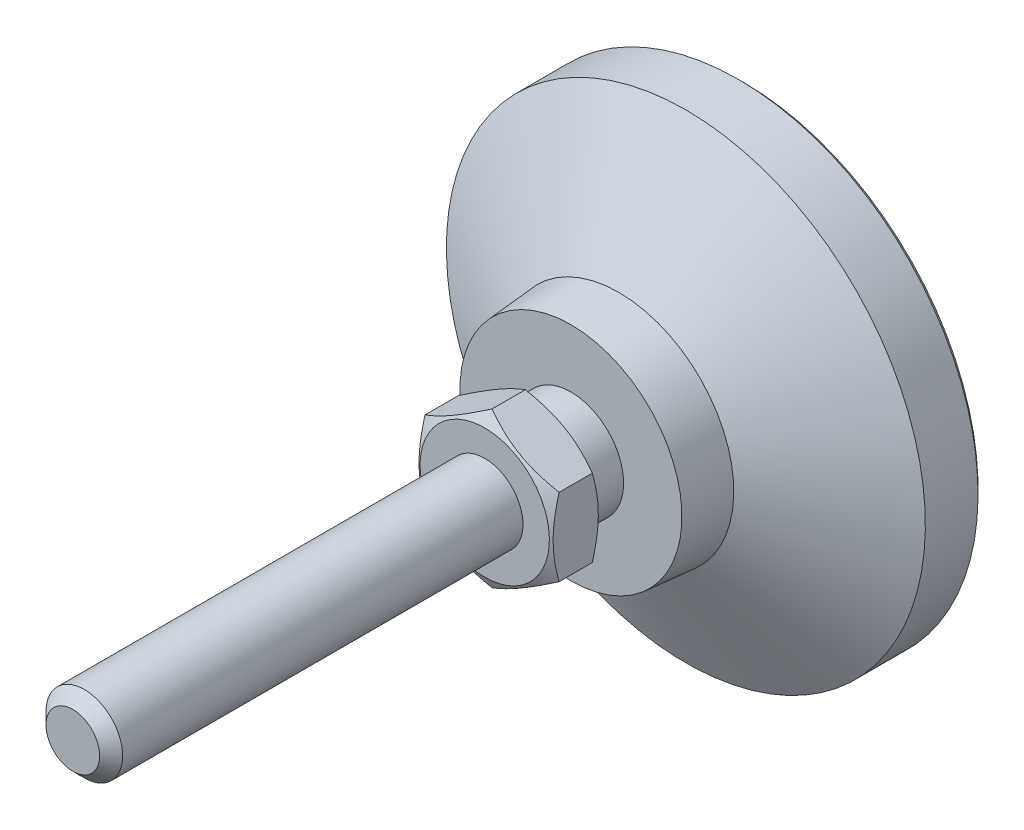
ISO-10303-21;
HEADER;
FILE_DESCRIPTION(('STEP AP214'),'2;1');
FILE_NAME('part.step','',(''),(''),'','','');
FILE_SCHEMA(('AUTOMOTIVE_DESIGN { 1 0 10303 214 1 1 1 1 }'));
ENDSEC;
DATA;
#1=APPLICATION_CONTEXT('core data for automotive mechanical design processes');
#2=APPLICATION_PROTOCOL_DEFINITION('international standard','automotive_design',2000,#1);
#3=PRODUCT_CONTEXT('',#1,'mechanical');
#4=PRODUCT('Part','Part','',(#3));
#5=PRODUCT_RELATED_PRODUCT_CATEGORY('part','',(#4));
#6=PRODUCT_DEFINITION_FORMATION('','',#4);
#7=PRODUCT_DEFINITION_CONTEXT('part definition',#1,'design');
#8=PRODUCT_DEFINITION('design','',#6,#7);
#9=PRODUCT_DEFINITION_SHAPE('','',#8);
#10=(LENGTH_UNIT() NAMED_UNIT(*) SI_UNIT(.MILLI.,.METRE.));
#11=(NAMED_UNIT(*) PLANE_ANGLE_UNIT() SI_UNIT($,.RADIAN.));
#12=(NAMED_UNIT(*) SI_UNIT($,.STERADIAN.) SOLID_ANGLE_UNIT());
#13=UNCERTAINTY_MEASURE_WITH_UNIT(LENGTH_MEASURE(1.E-05),#10,'distance_accuracy_value','');
#14=(GEOMETRIC_REPRESENTATION_CONTEXT(3) GLOBAL_UNCERTAINTY_ASSIGNED_CONTEXT((#13)) GLOBAL_UNIT_ASSIGNED_CONTEXT((#10,
#11,#12)) REPRESENTATION_CONTEXT('',''));
#15=CARTESIAN_POINT('',(0.,0.,0.));
#16=DIRECTION('',(0.,0.,1.));
#17=DIRECTION('',(1.,0.,0.));
#18=AXIS2_PLACEMENT_3D('',#15,#16,#17);
#19=CARTESIAN_POINT('',(0.,0.,-1.));
#20=DIRECTION('',(0.,0.,-1.));
#21=DIRECTION('',(0.,1.,0.));
#22=AXIS2_PLACEMENT_3D('',#19,#20,#21);
#23=CYLINDRICAL_SURFACE('',#22,5.49999999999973);
#24=CARTESIAN_POINT('',(0.,0.,22.));
#25=DIRECTION('',(0.,0.,-1.));
#26=DIRECTION('',(0.,1.,0.));
#27=AXIS2_PLACEMENT_3D('',#24,#25,#26);
#28=CIRCLE('',#27,5.49999999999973);
#29=CARTESIAN_POINT('',(0.,5.49999999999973,22.));
#30=VERTEX_POINT('',#29);
#31=EDGE_CURVE('E110',#30,#30,#28,.T.);
#32=ORIENTED_EDGE('',*,*,#31,.T.);
#33=EDGE_LOOP('',(#32));
#34=FACE_BOUND('',#33,.T.);
#35=CARTESIAN_POINT('',(0.,0.,18.));
#36=DIRECTION('',(0.,0.,-1.));
#37=DIRECTION('',(0.,1.,0.));
#38=AXIS2_PLACEMENT_3D('',#35,#36,#37);
#39=CIRCLE('',#38,5.49999999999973);
#40=CARTESIAN_POINT('',(0.,5.49999999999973,18.));
#41=VERTEX_POINT('',#40);
#42=EDGE_CURVE('E96',#41,#41,#39,.T.);
#43=ORIENTED_EDGE('',*,*,#42,.F.);
#44=EDGE_LOOP('',(#43));
#45=FACE_BOUND('',#44,.T.);
#46=ADVANCED_FACE('F14',(#34,#45),#23,.T.);
#47=CARTESIAN_POINT('',(-5.49999999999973,0.,22.));
#48=DIRECTION('',(0.,0.,1.));
#49=DIRECTION('',(0.,-1.,0.));
#50=AXIS2_PLACEMENT_3D('',#47,#48,#49);
#51=PLANE('',#50);
#52=CARTESIAN_POINT('',(0.,0.,22.));
#53=DIRECTION('',(0.,0.,1.));
#54=DIRECTION('',(0.,-1.,0.));
#55=AXIS2_PLACEMENT_3D('',#52,#53,#54);
#56=CIRCLE('',#55,6.75);
#57=CARTESIAN_POINT('',(0.,-6.75,22.));
#58=VERTEX_POINT('',#57);
#59=EDGE_CURVE('E85',#58,#58,#56,.T.);
#60=ORIENTED_EDGE('',*,*,#59,.F.);
#61=EDGE_LOOP('',(#60));
#62=FACE_BOUND('',#61,.T.);
#63=ORIENTED_EDGE('',*,*,#31,.F.);
#64=EDGE_LOOP('',(#63));
#65=FACE_BOUND('',#64,.T.);
#66=ADVANCED_FACE('F225',(#62,#65),#51,.F.);
#67=CARTESIAN_POINT('',(0.,-5.49999999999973,18.));
#68=DIRECTION('',(0.,0.,1.));
#69=DIRECTION('',(0.,-1.,0.));
#70=AXIS2_PLACEMENT_3D('',#67,#68,#69);
#71=PLANE('',#70);
#72=ORIENTED_EDGE('',*,*,#42,.T.);
#73=EDGE_LOOP('',(#72));
#74=FACE_BOUND('',#73,.T.);
#75=CARTESIAN_POINT('',(0.,0.,18.));
#76=DIRECTION('',(0.,0.,1.));
#77=DIRECTION('',(0.,-1.,0.));
#78=AXIS2_PLACEMENT_3D('',#75,#76,#77);
#79=CIRCLE('',#78,11.5833333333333);
#80=CARTESIAN_POINT('',(0.,-11.5833333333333,18.));
#81=VERTEX_POINT('',#80);
#82=EDGE_CURVE('E91',#81,#81,#79,.T.);
#83=ORIENTED_EDGE('',*,*,#82,.T.);
#84=EDGE_LOOP('',(#83));
#85=FACE_BOUND('',#84,.T.);
#86=ADVANCED_FACE('F137',(#74,#85),#71,.T.);
#87=CARTESIAN_POINT('',(0.,0.,0.));
#88=DIRECTION('',(0.,0.,-1.));
#89=DIRECTION('',(0.,1.,0.));
#90=AXIS2_PLACEMENT_3D('',#87,#88,#89);
#91=PLANE('',#90);
#92=CARTESIAN_POINT('',(0.,0.,0.));
#93=DIRECTION('',(0.,0.,-1.));
#94=DIRECTION('',(0.,1.,0.));
#95=AXIS2_PLACEMENT_3D('',#92,#93,#94);
#96=CIRCLE('',#95,24.5);
#97=CARTESIAN_POINT('',(0.,24.5,0.));
#98=VERTEX_POINT('',#97);
#99=EDGE_CURVE('E118',#98,#98,#96,.T.);
#100=ORIENTED_EDGE('',*,*,#99,.T.);
#101=EDGE_LOOP('',(#100));
#102=FACE_BOUND('',#101,.T.);
#103=ADVANCED_FACE('F182',(#102),#91,.T.);
#104=CARTESIAN_POINT('',(0.,0.,-1.));
#105=DIRECTION('',(0.,0.,-1.));
#106=DIRECTION('',(0.,1.,0.));
#107=AXIS2_PLACEMENT_3D('',#104,#105,#106);
#108=CYLINDRICAL_SURFACE('',#107,25.);
#109=CARTESIAN_POINT('',(0.,0.,0.500000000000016));
#110=DIRECTION('',(0.,0.,-1.));
#111=DIRECTION('',(0.,1.,0.));
#112=AXIS2_PLACEMENT_3D('',#109,#110,#111);
#113=CIRCLE('',#112,25.);
#114=CARTESIAN_POINT('',(0.,25.,0.500000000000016));
#115=VERTEX_POINT('',#114);
#116=EDGE_CURVE('E122',#115,#115,#113,.F.);
#117=ORIENTED_EDGE('',*,*,#116,.T.);
#118=EDGE_LOOP('',(#117));
#119=FACE_BOUND('',#118,.T.);
#120=CARTESIAN_POINT('',(0.,0.,6.00000000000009));
#121=DIRECTION('',(0.,0.,-1.));
#122=DIRECTION('',(0.,1.,0.));
#123=AXIS2_PLACEMENT_3D('',#120,#121,#122);
#124=CIRCLE('',#123,25.);
#125=CARTESIAN_POINT('',(0.,25.,6.00000000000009));
#126=VERTEX_POINT('',#125);
#127=EDGE_CURVE('E116',#126,#126,#124,.T.);
#128=ORIENTED_EDGE('',*,*,#127,.T.);
#129=EDGE_LOOP('',(#128));
#130=FACE_BOUND('',#129,.T.);
#131=ADVANCED_FACE('F243',(#119,#130),#108,.T.);
#132=CARTESIAN_POINT('',(0.,0.,13.));
#133=DIRECTION('',(0.,0.,-1.));
#134=DIRECTION('',(0.,1.,0.));
#135=AXIS2_PLACEMENT_3D('',#132,#133,#134);
#136=CONICAL_SURFACE('',#135,12.,1.07685495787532);
#137=ORIENTED_EDGE('',*,*,#127,.F.);
#138=EDGE_LOOP('',(#137));
#139=FACE_BOUND('',#138,.T.);
#140=CARTESIAN_POINT('',(0.,0.,13.));
#141=DIRECTION('',(0.,0.,-1.));
#142=DIRECTION('',(0.,1.,0.));
#143=AXIS2_PLACEMENT_3D('',#140,#141,#142);
#144=CIRCLE('',#143,12.);
#145=CARTESIAN_POINT('',(0.,12.,13.));
#146=VERTEX_POINT('',#145);
#147=EDGE_CURVE('E113',#146,#146,#144,.T.);
#148=ORIENTED_EDGE('',*,*,#147,.T.);
#149=EDGE_LOOP('',(#148));
#150=FACE_BOUND('',#149,.T.);
#151=ADVANCED_FACE('F240',(#139,#150),#136,.T.);
#152=CARTESIAN_POINT('',(0.,0.,19.));
#153=DIRECTION('',(0.,0.,-1.));
#154=DIRECTION('',(0.,1.,0.));
#155=AXIS2_PLACEMENT_3D('',#152,#153,#154);
#156=CONICAL_SURFACE('',#155,11.5,0.0831412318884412);
#157=ORIENTED_EDGE('',*,*,#147,.F.);
#158=EDGE_LOOP('',(#157));
#159=FACE_BOUND('',#158,.T.);
#160=ORIENTED_EDGE('',*,*,#82,.F.);
#161=EDGE_LOOP('',(#160));
#162=FACE_BOUND('',#161,.T.);
#163=ADVANCED_FACE('F237',(#159,#162),#156,.T.);
#164=CARTESIAN_POINT('',(0.,0.,0.));
#165=DIRECTION('',(0.,0.,1.));
#166=DIRECTION('',(0.,-1.,0.));
#167=AXIS2_PLACEMENT_3D('',#164,#165,#166);
#168=CONICAL_SURFACE('',#167,24.5,0.785398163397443);
#169=ORIENTED_EDGE('',*,*,#116,.F.);
#170=EDGE_LOOP('',(#169));
#171=FACE_BOUND('',#170,.T.);
#172=ORIENTED_EDGE('',*,*,#99,.F.);
#173=EDGE_LOOP('',(#172));
#174=FACE_BOUND('',#173,.T.);
#175=ADVANCED_FACE('F16',(#171,#174),#168,.T.);
#176=CARTESIAN_POINT('',(0.,0.,22.));
#177=DIRECTION('',(0.,0.,1.));
#178=DIRECTION('',(0.,-1.,0.));
#179=AXIS2_PLACEMENT_3D('',#176,#177,#178);
#180=CONICAL_SURFACE('',#179,6.75,1.0471975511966);
#181=CARTESIAN_POINT('',(0.000200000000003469,-8.0830192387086,22.7696190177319));
#182=CARTESIAN_POINT('',(-0.15366790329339,-7.99418356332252,22.7183374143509));
#183=CARTESIAN_POINT('',(-0.308109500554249,-7.90501666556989,22.669383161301));
#184=CARTESIAN_POINT('',(-0.618246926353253,-7.72595873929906,22.5767703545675));
#185=CARTESIAN_POINT('',(-0.773943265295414,-7.63606741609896,22.5331140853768));
#186=CARTESIAN_POINT('',(-1.24352516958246,-7.36495417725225,22.4109491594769));
#187=CARTESIAN_POINT('',(-1.5592643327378,-7.18266208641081,22.3414631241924));
#188=CARTESIAN_POINT('',(-2.03176224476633,-6.90986528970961,22.2599825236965));
#189=CARTESIAN_POINT('',(-2.18710922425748,-6.82017566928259,22.2367710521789));
#190=CARTESIAN_POINT('',(-2.49850511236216,-6.64039116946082,22.1978487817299));
#191=CARTESIAN_POINT('',(-2.65455395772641,-6.55029632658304,22.1821373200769));
#192=CARTESIAN_POINT('',(-2.96692267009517,-6.36995016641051,22.1586154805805));
#193=CARTESIAN_POINT('',(-3.12324202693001,-6.27969914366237,22.1507961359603));
#194=CARTESIAN_POINT('',(-3.43601650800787,-6.09911871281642,22.1432178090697));
#195=CARTESIAN_POINT('',(-3.59247162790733,-6.00878930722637,22.1434585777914));
#196=CARTESIAN_POINT('',(-4.02110687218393,-5.76131663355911,22.155197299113));
#197=CARTESIAN_POINT('',(-4.29314668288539,-5.60425437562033,22.1749033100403));
#198=CARTESIAN_POINT('',(-4.83541944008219,-5.29117305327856,22.2373910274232));
#199=CARTESIAN_POINT('',(-5.10565047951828,-5.13515508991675,22.2801940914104));
#200=CARTESIAN_POINT('',(-5.64901454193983,-4.82144370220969,22.3871892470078));
#201=CARTESIAN_POINT('',(-5.92207900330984,-4.6637898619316,22.4518346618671));
#202=CARTESIAN_POINT('',(-6.46413578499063,-4.35083323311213,22.5985536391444));
#203=CARTESIAN_POINT('',(-6.73313504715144,-4.19552643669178,22.680592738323));
#204=CARTESIAN_POINT('',(-7.0002,-4.04133641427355,22.7696190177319));
#205=B_SPLINE_CURVE_WITH_KNOTS('',3,(#181,#182,#183,#184,#185,#186,#187,#188,#189,#190,#191,
#192,#193,#194,#195,#196,#197,#198,#199,#200,#201,#202,#203,#204),.UNSPECIFIED.,.F.,.F.,(4,2,2,
2,2,2,2,2,2,2,2,4),(0.,0.554727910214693,1.10969417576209,2.2219327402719,2.76443041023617,
3.30688013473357,3.84871284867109,4.39052882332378,5.33376515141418,6.27787517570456,
7.2429241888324,8.20607866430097),.UNSPECIFIED.);
#206=CARTESIAN_POINT('',(0.,-8.08290376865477,22.7695523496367));
#207=VERTEX_POINT('',#206);
#208=CARTESIAN_POINT('',(-7.,-4.04145188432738,22.7695523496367));
#209=VERTEX_POINT('',#208);
#210=EDGE_CURVE('E90',#207,#209,#205,.T.);
#211=ORIENTED_EDGE('',*,*,#210,.T.);
#212=CARTESIAN_POINT('',(-7.,10.8261952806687,25.5461489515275));
#213=CARTESIAN_POINT('',(-7.,10.5207055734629,25.3980784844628));
#214=CARTESIAN_POINT('',(-7.,10.2145114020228,25.2514363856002));
#215=CARTESIAN_POINT('',(-7.,9.60033936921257,24.9618128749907));
#216=CARTESIAN_POINT('',(-7.,9.29236123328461,24.818832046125));
#217=CARTESIAN_POINT('',(-7.,8.6726454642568,24.5366093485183));
#218=CARTESIAN_POINT('',(-7.,8.36089647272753,24.3973923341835));
#219=CARTESIAN_POINT('',(-7.,7.7349085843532,24.1246953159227));
#220=CARTESIAN_POINT('',(-7.,7.42066980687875,23.9912150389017));
#221=CARTESIAN_POINT('',(-7.,6.77917625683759,23.7273836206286));
#222=CARTESIAN_POINT('',(-7.,6.4518248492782,23.5972661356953));
#223=CARTESIAN_POINT('',(-7.,5.79328211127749,23.346950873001));
#224=CARTESIAN_POINT('',(-7.,5.46209035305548,23.2267542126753));
#225=CARTESIAN_POINT('',(-7.,4.79596552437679,22.9994580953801));
#226=CARTESIAN_POINT('',(-7.,4.46104168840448,22.892331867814));
#227=CARTESIAN_POINT('',(-7.,3.78640204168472,22.6946321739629));
#228=CARTESIAN_POINT('',(-7.,3.44668778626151,22.6040534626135));
#229=CARTESIAN_POINT('',(-7.,2.76409652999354,22.4443011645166));
#230=CARTESIAN_POINT('',(-7.,2.42124716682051,22.3750126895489));
#231=CARTESIAN_POINT('',(-7.,1.90387487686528,22.2900623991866));
#232=CARTESIAN_POINT('',(-7.,1.73088814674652,22.2649082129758));
#233=CARTESIAN_POINT('',(-7.,1.38406496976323,22.2214213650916));
#234=CARTESIAN_POINT('',(-7.,1.21022860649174,22.2030880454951));
#235=CARTESIAN_POINT('',(-7.,0.864197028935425,22.1738365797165));
#236=CARTESIAN_POINT('',(-7.,0.692009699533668,22.1628255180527));
#237=CARTESIAN_POINT('',(-7.,0.34732385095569,22.1480926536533));
#238=CARTESIAN_POINT('',(-7.,0.174825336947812,22.1443707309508));
#239=CARTESIAN_POINT('',(-7.,-0.170174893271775,22.1443048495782));
#240=CARTESIAN_POINT('',(-7.,-0.342676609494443,22.1479609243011));
#241=CARTESIAN_POINT('',(-7.,-0.687373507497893,22.1625622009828));
#242=CARTESIAN_POINT('',(-7.,-0.859568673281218,22.1735077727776));
#243=CARTESIAN_POINT('',(-7.,-1.27430760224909,22.2084187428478));
#244=CARTESIAN_POINT('',(-7.,-1.5165621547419,22.235892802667));
#245=CARTESIAN_POINT('',(-7.,-1.99924233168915,22.3037628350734));
#246=CARTESIAN_POINT('',(-7.,-2.2396676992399,22.3441605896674));
#247=CARTESIAN_POINT('',(-7.,-2.9579424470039,22.4825946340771));
#248=CARTESIAN_POINT('',(-7.,-3.43251618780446,22.5978455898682));
#249=CARTESIAN_POINT('',(-7.,-4.14209330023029,22.7973137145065));
#250=CARTESIAN_POINT('',(-7.,-4.38078691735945,22.8691550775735));
#251=CARTESIAN_POINT('',(-7.,-4.85585510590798,23.0202030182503));
#252=CARTESIAN_POINT('',(-7.,-5.09222966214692,23.0994096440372));
#253=CARTESIAN_POINT('',(-7.,-5.56273596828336,23.2639252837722));
#254=CARTESIAN_POINT('',(-7.,-5.79686845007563,23.3492322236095));
#255=CARTESIAN_POINT('',(-7.,-6.26320003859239,23.5249543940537));
#256=CARTESIAN_POINT('',(-7.,-6.49539916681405,23.6153695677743));
#257=CARTESIAN_POINT('',(-7.,-7.03870646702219,23.8327117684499));
#258=CARTESIAN_POINT('',(-7.,-7.34911564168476,23.9613827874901));
#259=CARTESIAN_POINT('',(-7.,-7.96733547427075,24.2248403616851));
#260=CARTESIAN_POINT('',(-7.,-8.27514597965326,24.3596272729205));
#261=CARTESIAN_POINT('',(-7.,-8.88864034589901,24.6341014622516));
#262=CARTESIAN_POINT('',(-7.,-9.19432378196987,24.7737896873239));
#263=CARTESIAN_POINT('',(-7.,-9.80386715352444,25.0570964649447));
#264=CARTESIAN_POINT('',(-7.,-10.1077270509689,25.2007150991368));
#265=CARTESIAN_POINT('',(-7.,-10.7142274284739,25.4913001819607));
#266=CARTESIAN_POINT('',(-7.,-11.0168663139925,25.6382699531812));
#267=CARTESIAN_POINT('',(-7.,-11.6208489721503,25.9348494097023));
#268=CARTESIAN_POINT('',(-7.,-11.9221927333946,26.0844591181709));
#269=CARTESIAN_POINT('',(-7.,-12.8245105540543,26.5365141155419));
#270=CARTESIAN_POINT('',(-7.,-13.4238493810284,26.8422230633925));
#271=CARTESIAN_POINT('',(-7.,-14.5699747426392,27.4342763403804));
#272=CARTESIAN_POINT('',(-7.,-15.1170134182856,27.7201347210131));
#273=CARTESIAN_POINT('',(-7.,-16.209054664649,28.2957564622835));
#274=CARTESIAN_POINT('',(-7.,-16.7540571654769,28.5855199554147));
#275=CARTESIAN_POINT('',(-7.,-17.8411487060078,29.1673182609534));
#276=CARTESIAN_POINT('',(-7.,-18.3832416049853,29.4593458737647));
#277=CARTESIAN_POINT('',(-7.,-19.4661229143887,30.0457416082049));
#278=CARTESIAN_POINT('',(-7.,-20.0069113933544,30.3401096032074));
#279=CARTESIAN_POINT('',(-7.,-20.547218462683,30.6353526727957));
#280=B_SPLINE_CURVE_WITH_KNOTS('',3,(#212,#213,#214,#215,#216,#217,#218,#219,#220,#221,#222,
#223,#224,#225,#226,#227,#228,#229,#230,#231,#232,#233,#234,#235,#236,#237,#238,#239,#240,#241,
#242,#243,#244,#245,#246,#247,#248,#249,#250,#251,#252,#253,#254,#255,#256,#257,#258,#259,#260,
#261,#262,#263,#264,#265,#266,#267,#268,#269,#270,#271,#272,#273,#274,#275,#276,#277,#278,#279),
.UNSPECIFIED.,.F.,.F.,(4,2,2,2,2,2,2,2,2,2,2,2,2,2,2,2,2,2,2,2,2,2,2,2,2,2,2,2,2,2,2,2,2,4),(0.,
1.01846209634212,2.03708533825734,3.06130428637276,4.08547442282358,5.14213987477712,
6.19892418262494,7.25350631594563,8.30775359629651,9.35620768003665,9.88051238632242,
10.4047665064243,10.9222342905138,11.4396935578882,11.9571551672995,12.4746430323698,
13.2056518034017,13.936761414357,15.3998035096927,16.1475540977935,16.8953095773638,
17.6428120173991,18.3903061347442,19.3982811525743,20.4063149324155,21.4145445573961,
22.422795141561,23.4320930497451,24.4413998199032,26.4597527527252,28.3114100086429,
30.1631302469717,32.0103662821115,33.857503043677),.UNSPECIFIED.);
#281=CARTESIAN_POINT('',(-7.,4.04145188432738,22.7695523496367));
#282=VERTEX_POINT('',#281);
#283=EDGE_CURVE('E166',#209,#282,#280,.F.);
#284=ORIENTED_EDGE('',*,*,#283,.T.);
#285=CARTESIAN_POINT('',(-7.0002,4.04133641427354,22.7696190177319));
#286=CARTESIAN_POINT('',(-6.84633209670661,4.13017208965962,22.7183374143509));
#287=CARTESIAN_POINT('',(-6.69189049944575,4.21933898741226,22.669383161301));
#288=CARTESIAN_POINT('',(-6.38175307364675,4.39839691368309,22.5767703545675));
#289=CARTESIAN_POINT('',(-6.22605673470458,4.48828823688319,22.5331140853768));
#290=CARTESIAN_POINT('',(-5.75647483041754,4.75940147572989,22.4109491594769));
#291=CARTESIAN_POINT('',(-5.4407356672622,4.94169356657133,22.3414631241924));
#292=CARTESIAN_POINT('',(-4.96823775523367,5.21449036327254,22.2599825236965));
#293=CARTESIAN_POINT('',(-4.81289077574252,5.30417998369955,22.2367710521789));
#294=CARTESIAN_POINT('',(-4.50149488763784,5.48396448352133,22.1978487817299));
#295=CARTESIAN_POINT('',(-4.34544604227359,5.57405932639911,22.1821373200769));
#296=CARTESIAN_POINT('',(-4.03307732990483,5.75440548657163,22.1586154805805));
#297=CARTESIAN_POINT('',(-3.87675797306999,5.84465650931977,22.1507961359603));
#298=CARTESIAN_POINT('',(-3.56398349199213,6.02523694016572,22.1432178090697));
#299=CARTESIAN_POINT('',(-3.40752837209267,6.11556634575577,22.1434585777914));
#300=CARTESIAN_POINT('',(-2.97889312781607,6.36303901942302,22.155197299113));
#301=CARTESIAN_POINT('',(-2.7068533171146,6.52010127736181,22.1749033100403));
#302=CARTESIAN_POINT('',(-2.16458055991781,6.83318259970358,22.2373910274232));
#303=CARTESIAN_POINT('',(-1.89434952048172,6.9892005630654,22.2801940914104));
#304=CARTESIAN_POINT('',(-1.35098545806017,7.30291195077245,22.3871892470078));
#305=CARTESIAN_POINT('',(-1.07792099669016,7.46056579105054,22.4518346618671));
#306=CARTESIAN_POINT('',(-0.535864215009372,7.77352241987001,22.5985536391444));
#307=CARTESIAN_POINT('',(-0.266864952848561,7.92882921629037,22.680592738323));
#308=CARTESIAN_POINT('',(0.000199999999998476,8.0830192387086,22.7696190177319));
#309=B_SPLINE_CURVE_WITH_KNOTS('',3,(#285,#286,#287,#288,#289,#290,#291,#292,#293,#294,#295,
#296,#297,#298,#299,#300,#301,#302,#303,#304,#305,#306,#307,#308),.UNSPECIFIED.,.F.,.F.,(4,2,2,
2,2,2,2,2,2,2,2,4),(0.,0.554727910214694,1.10969417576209,2.2219327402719,2.76443041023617,
3.30688013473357,3.84871284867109,4.39052882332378,5.33376515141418,6.27787517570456,
7.2429241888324,8.20607866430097),.UNSPECIFIED.);
#310=CARTESIAN_POINT('',(0.,8.08290376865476,22.7695523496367));
#311=VERTEX_POINT('',#310);
#312=EDGE_CURVE('E159',#282,#311,#309,.T.);
#313=ORIENTED_EDGE('',*,*,#312,.T.);
#314=CARTESIAN_POINT('',(-0.000200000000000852,8.0830192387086,22.7696190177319));
#315=CARTESIAN_POINT('',(0.153667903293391,7.99418356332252,22.7183374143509));
#316=CARTESIAN_POINT('',(0.308109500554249,7.90501666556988,22.669383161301));
#317=CARTESIAN_POINT('',(0.618246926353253,7.72595873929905,22.5767703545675));
#318=CARTESIAN_POINT('',(0.773943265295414,7.63606741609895,22.5331140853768));
#319=CARTESIAN_POINT('',(1.24352516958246,7.36495417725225,22.4109491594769));
#320=CARTESIAN_POINT('',(1.5592643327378,7.18266208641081,22.3414631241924));
#321=CARTESIAN_POINT('',(2.03176224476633,6.9098652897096,22.2599825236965));
#322=CARTESIAN_POINT('',(2.18710922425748,6.82017566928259,22.2367710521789));
#323=CARTESIAN_POINT('',(2.49850511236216,6.64039116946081,22.1978487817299));
#324=CARTESIAN_POINT('',(2.65455395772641,6.55029632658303,22.1821373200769));
#325=CARTESIAN_POINT('',(2.96692267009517,6.36995016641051,22.1586154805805));
#326=CARTESIAN_POINT('',(3.12324202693,6.27969914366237,22.1507961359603));
#327=CARTESIAN_POINT('',(3.43601650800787,6.09911871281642,22.1432178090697));
#328=CARTESIAN_POINT('',(3.59247162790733,6.00878930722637,22.1434585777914));
#329=CARTESIAN_POINT('',(4.02110687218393,5.76131663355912,22.155197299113));
#330=CARTESIAN_POINT('',(4.2931466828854,5.60425437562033,22.1749033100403));
#331=CARTESIAN_POINT('',(4.83541944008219,5.29117305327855,22.2373910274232));
#332=CARTESIAN_POINT('',(5.10565047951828,5.13515508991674,22.2801940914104));
#333=CARTESIAN_POINT('',(5.64901454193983,4.82144370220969,22.3871892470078));
#334=CARTESIAN_POINT('',(5.92207900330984,4.66378986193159,22.4518346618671));
#335=CARTESIAN_POINT('',(6.46413578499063,4.35083323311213,22.5985536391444));
#336=CARTESIAN_POINT('',(6.73313504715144,4.19552643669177,22.680592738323));
#337=CARTESIAN_POINT('',(7.0002,4.04133641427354,22.7696190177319));
#338=B_SPLINE_CURVE_WITH_KNOTS('',3,(#314,#315,#316,#317,#318,#319,#320,#321,#322,#323,#324,
#325,#326,#327,#328,#329,#330,#331,#332,#333,#334,#335,#336,#337),.UNSPECIFIED.,.F.,.F.,(4,2,2,
2,2,2,2,2,2,2,2,4),(0.,0.554727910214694,1.10969417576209,2.2219327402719,2.76443041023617,
3.30688013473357,3.8487128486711,4.39052882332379,5.33376515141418,6.27787517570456,
7.2429241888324,8.20607866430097),.UNSPECIFIED.);
#339=CARTESIAN_POINT('',(7.,4.04145188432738,22.7695523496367));
#340=VERTEX_POINT('',#339);
#341=EDGE_CURVE('E152',#311,#340,#338,.T.);
#342=ORIENTED_EDGE('',*,*,#341,.T.);
#343=CARTESIAN_POINT('',(7.,10.8261952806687,25.5461489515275));
#344=CARTESIAN_POINT('',(7.,10.5207055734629,25.3980784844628));
#345=CARTESIAN_POINT('',(7.,10.2145114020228,25.2514363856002));
#346=CARTESIAN_POINT('',(7.,9.60033936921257,24.9618128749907));
#347=CARTESIAN_POINT('',(7.,9.29236123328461,24.818832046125));
#348=CARTESIAN_POINT('',(7.,8.6726454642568,24.5366093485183));
#349=CARTESIAN_POINT('',(7.,8.36089647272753,24.3973923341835));
#350=CARTESIAN_POINT('',(7.,7.7349085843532,24.1246953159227));
#351=CARTESIAN_POINT('',(7.,7.42066980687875,23.9912150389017));
#352=CARTESIAN_POINT('',(7.,6.77917625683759,23.7273836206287));
#353=CARTESIAN_POINT('',(7.,6.45182484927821,23.5972661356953));
#354=CARTESIAN_POINT('',(7.,5.79328211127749,23.346950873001));
#355=CARTESIAN_POINT('',(7.,5.46209035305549,23.2267542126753));
#356=CARTESIAN_POINT('',(7.,4.7959655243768,22.9994580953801));
#357=CARTESIAN_POINT('',(7.,4.46104168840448,22.892331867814));
#358=CARTESIAN_POINT('',(7.,3.78640204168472,22.6946321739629));
#359=CARTESIAN_POINT('',(7.,3.44668778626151,22.6040534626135));
#360=CARTESIAN_POINT('',(7.,2.76409652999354,22.4443011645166));
#361=CARTESIAN_POINT('',(7.,2.42124716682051,22.3750126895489));
#362=CARTESIAN_POINT('',(7.,1.90387487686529,22.2900623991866));
#363=CARTESIAN_POINT('',(7.,1.73088814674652,22.2649082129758));
#364=CARTESIAN_POINT('',(7.,1.38406496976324,22.2214213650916));
#365=CARTESIAN_POINT('',(7.,1.21022860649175,22.2030880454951));
#366=CARTESIAN_POINT('',(7.,0.864197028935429,22.1738365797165));
#367=CARTESIAN_POINT('',(7.,0.692009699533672,22.1628255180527));
#368=CARTESIAN_POINT('',(7.,0.347323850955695,22.1480926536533));
#369=CARTESIAN_POINT('',(7.,0.174825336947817,22.1443707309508));
#370=CARTESIAN_POINT('',(7.,-0.170174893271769,22.1443048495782));
#371=CARTESIAN_POINT('',(7.,-0.342676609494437,22.1479609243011));
#372=CARTESIAN_POINT('',(7.,-0.687373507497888,22.1625622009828));
#373=CARTESIAN_POINT('',(7.,-0.859568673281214,22.1735077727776));
#374=CARTESIAN_POINT('',(7.,-1.27430760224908,22.2084187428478));
#375=CARTESIAN_POINT('',(7.,-1.5165621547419,22.235892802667));
#376=CARTESIAN_POINT('',(7.,-1.99924233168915,22.3037628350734));
#377=CARTESIAN_POINT('',(7.,-2.2396676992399,22.3441605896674));
#378=CARTESIAN_POINT('',(7.,-2.9579424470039,22.4825946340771));
#379=CARTESIAN_POINT('',(7.,-3.43251618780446,22.5978455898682));
#380=CARTESIAN_POINT('',(7.,-4.14209330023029,22.7973137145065));
#381=CARTESIAN_POINT('',(7.,-4.38078691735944,22.8691550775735));
#382=CARTESIAN_POINT('',(7.,-4.85585510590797,23.0202030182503));
#383=CARTESIAN_POINT('',(7.,-5.09222966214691,23.0994096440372));
#384=CARTESIAN_POINT('',(7.,-5.56273596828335,23.2639252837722));
#385=CARTESIAN_POINT('',(7.,-5.79686845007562,23.3492322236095));
#386=CARTESIAN_POINT('',(7.,-6.26320003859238,23.5249543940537));
#387=CARTESIAN_POINT('',(7.,-6.49539916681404,23.6153695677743));
#388=CARTESIAN_POINT('',(7.,-7.03870646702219,23.8327117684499));
#389=CARTESIAN_POINT('',(7.,-7.34911564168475,23.9613827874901));
#390=CARTESIAN_POINT('',(7.,-7.96733547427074,24.2248403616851));
#391=CARTESIAN_POINT('',(7.,-8.27514597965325,24.3596272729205));
#392=CARTESIAN_POINT('',(7.,-8.88864034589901,24.6341014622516));
#393=CARTESIAN_POINT('',(7.,-9.19432378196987,24.7737896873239));
#394=CARTESIAN_POINT('',(7.,-9.80386715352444,25.0570964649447));
#395=CARTESIAN_POINT('',(7.,-10.1077270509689,25.2007150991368));
#396=CARTESIAN_POINT('',(7.,-10.7142274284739,25.4913001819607));
#397=CARTESIAN_POINT('',(7.,-11.0168663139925,25.6382699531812));
#398=CARTESIAN_POINT('',(7.,-11.6208489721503,25.9348494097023));
#399=CARTESIAN_POINT('',(7.,-11.9221927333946,26.0844591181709));
#400=CARTESIAN_POINT('',(7.,-12.8245105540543,26.5365141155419));
#401=CARTESIAN_POINT('',(7.,-13.4238493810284,26.8422230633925));
#402=CARTESIAN_POINT('',(7.,-14.5699747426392,27.4342763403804));
#403=CARTESIAN_POINT('',(7.,-15.1170134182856,27.7201347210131));
#404=CARTESIAN_POINT('',(7.,-16.209054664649,28.2957564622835));
#405=CARTESIAN_POINT('',(7.,-16.7540571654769,28.5855199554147));
#406=CARTESIAN_POINT('',(7.,-17.8411487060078,29.1673182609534));
#407=CARTESIAN_POINT('',(7.,-18.3832416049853,29.4593458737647));
#408=CARTESIAN_POINT('',(7.,-19.4661229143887,30.0457416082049));
#409=CARTESIAN_POINT('',(7.,-20.0069113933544,30.3401096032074));
#410=CARTESIAN_POINT('',(7.,-20.547218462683,30.6353526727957));
#411=B_SPLINE_CURVE_WITH_KNOTS('',3,(#343,#344,#345,#346,#347,#348,#349,#350,#351,#352,#353,
#354,#355,#356,#357,#358,#359,#360,#361,#362,#363,#364,#365,#366,#367,#368,#369,#370,#371,#372,
#373,#374,#375,#376,#377,#378,#379,#380,#381,#382,#383,#384,#385,#386,#387,#388,#389,#390,#391,
#392,#393,#394,#395,#396,#397,#398,#399,#400,#401,#402,#403,#404,#405,#406,#407,#408,#409,#410),
.UNSPECIFIED.,.F.,.F.,(4,2,2,2,2,2,2,2,2,2,2,2,2,2,2,2,2,2,2,2,2,2,2,2,2,2,2,2,2,2,2,2,2,4),(0.,
1.01846209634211,2.03708533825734,3.06130428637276,4.08547442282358,5.14213987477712,
6.19892418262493,7.25350631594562,8.30775359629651,9.35620768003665,9.88051238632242,
10.4047665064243,10.9222342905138,11.4396935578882,11.9571551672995,12.4746430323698,
13.2056518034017,13.936761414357,15.3998035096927,16.1475540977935,16.8953095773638,
17.6428120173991,18.3903061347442,19.3982811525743,20.4063149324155,21.4145445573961,
22.422795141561,23.4320930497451,24.4413998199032,26.4597527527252,28.3114100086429,
30.1631302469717,32.0103662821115,33.857503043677),.UNSPECIFIED.);
#412=CARTESIAN_POINT('',(7.,-4.04145188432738,22.7695523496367));
#413=VERTEX_POINT('',#412);
#414=EDGE_CURVE('E42',#340,#413,#411,.T.);
#415=ORIENTED_EDGE('',*,*,#414,.T.);
#416=CARTESIAN_POINT('',(7.0002,-4.04133641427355,22.7696190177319));
#417=CARTESIAN_POINT('',(6.84633209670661,-4.13017208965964,22.7183374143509));
#418=CARTESIAN_POINT('',(6.69189049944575,-4.21933898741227,22.669383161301));
#419=CARTESIAN_POINT('',(6.38175307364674,-4.3983969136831,22.5767703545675));
#420=CARTESIAN_POINT('',(6.22605673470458,-4.4882882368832,22.5331140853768));
#421=CARTESIAN_POINT('',(5.75647483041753,-4.7594014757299,22.4109491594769));
#422=CARTESIAN_POINT('',(5.4407356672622,-4.94169356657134,22.3414631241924));
#423=CARTESIAN_POINT('',(4.96823775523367,-5.21449036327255,22.2599825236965));
#424=CARTESIAN_POINT('',(4.81289077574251,-5.30417998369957,22.2367710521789));
#425=CARTESIAN_POINT('',(4.50149488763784,-5.48396448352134,22.1978487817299));
#426=CARTESIAN_POINT('',(4.34544604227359,-5.57405932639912,22.1821373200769));
#427=CARTESIAN_POINT('',(4.03307732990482,-5.75440548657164,22.1586154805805));
#428=CARTESIAN_POINT('',(3.87675797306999,-5.84465650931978,22.1507961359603));
#429=CARTESIAN_POINT('',(3.56398349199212,-6.02523694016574,22.1432178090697));
#430=CARTESIAN_POINT('',(3.40752837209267,-6.11556634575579,22.1434585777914));
#431=CARTESIAN_POINT('',(2.97889312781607,-6.36303901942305,22.155197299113));
#432=CARTESIAN_POINT('',(2.7068533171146,-6.52010127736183,22.1749033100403));
#433=CARTESIAN_POINT('',(2.1645805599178,-6.83318259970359,22.2373910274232));
#434=CARTESIAN_POINT('',(1.89434952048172,-6.98920056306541,22.2801940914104));
#435=CARTESIAN_POINT('',(1.35098545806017,-7.30291195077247,22.3871892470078));
#436=CARTESIAN_POINT('',(1.07792099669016,-7.46056579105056,22.4518346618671));
#437=CARTESIAN_POINT('',(0.535864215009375,-7.77352241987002,22.5985536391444));
#438=CARTESIAN_POINT('',(0.266864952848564,-7.92882921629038,22.680592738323));
#439=CARTESIAN_POINT('',(-0.000199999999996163,-8.08301923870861,22.7696190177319));
#440=B_SPLINE_CURVE_WITH_KNOTS('',3,(#416,#417,#418,#419,#420,#421,#422,#423,#424,#425,#426,
#427,#428,#429,#430,#431,#432,#433,#434,#435,#436,#437,#438,#439),.UNSPECIFIED.,.F.,.F.,(4,2,2,
2,2,2,2,2,2,2,2,4),(0.,0.554727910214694,1.10969417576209,2.2219327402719,2.76443041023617,
3.30688013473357,3.8487128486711,4.39052882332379,5.33376515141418,6.27787517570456,
7.24292418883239,8.20607866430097),.UNSPECIFIED.);
#441=EDGE_CURVE('E28',#413,#207,#440,.T.);
#442=ORIENTED_EDGE('',*,*,#441,.T.);
#443=EDGE_LOOP('',(#211,#284,#313,#342,#415,#442));
#444=FACE_BOUND('',#443,.T.);
#445=ORIENTED_EDGE('',*,*,#59,.T.);
#446=EDGE_LOOP('',(#445));
#447=FACE_BOUND('',#446,.T.);
#448=ADVANCED_FACE('F132',(#444,#447),#180,.T.);
#449=CARTESIAN_POINT('',(0.,-8.08290376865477,22.));
#450=DIRECTION('',(0.5,-0.866025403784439,0.));
#451=DIRECTION('',(0.866025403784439,0.5,0.));
#452=AXIS2_PLACEMENT_3D('',#449,#450,#451);
#453=PLANE('',#452);
#454=CARTESIAN_POINT('',(-0.000199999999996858,-8.08301923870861,26.2303809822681));
#455=CARTESIAN_POINT('',(0.153667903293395,-7.99418356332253,26.2816625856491));
#456=CARTESIAN_POINT('',(0.308109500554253,-7.90501666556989,26.330616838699));
#457=CARTESIAN_POINT('',(0.618246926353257,-7.72595873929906,26.4232296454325));
#458=CARTESIAN_POINT('',(0.773943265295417,-7.63606741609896,26.4668859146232));
#459=CARTESIAN_POINT('',(1.24352516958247,-7.36495417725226,26.5890508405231));
#460=CARTESIAN_POINT('',(1.5592643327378,-7.18266208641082,26.6585368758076));
#461=CARTESIAN_POINT('',(2.03176224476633,-6.90986528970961,26.7400174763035));
#462=CARTESIAN_POINT('',(2.18710922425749,-6.8201756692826,26.7632289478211));
#463=CARTESIAN_POINT('',(2.49850511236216,-6.64039116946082,26.8021512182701));
#464=CARTESIAN_POINT('',(2.65455395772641,-6.55029632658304,26.8178626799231));
#465=CARTESIAN_POINT('',(2.96692267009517,-6.36995016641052,26.8413845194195));
#466=CARTESIAN_POINT('',(3.12324202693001,-6.27969914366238,26.8492038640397));
#467=CARTESIAN_POINT('',(3.43601650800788,-6.09911871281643,26.8567821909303));
#468=CARTESIAN_POINT('',(3.59247162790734,-6.00878930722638,26.8565414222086));
#469=CARTESIAN_POINT('',(4.02110687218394,-5.76131663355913,26.844802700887));
#470=CARTESIAN_POINT('',(4.2931466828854,-5.60425437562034,26.8250966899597));
#471=CARTESIAN_POINT('',(4.8354194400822,-5.29117305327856,26.7626089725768));
#472=CARTESIAN_POINT('',(5.10565047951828,-5.13515508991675,26.7198059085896));
#473=CARTESIAN_POINT('',(5.64901454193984,-4.8214437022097,26.6128107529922));
#474=CARTESIAN_POINT('',(5.92207900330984,-4.6637898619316,26.5481653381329));
#475=CARTESIAN_POINT('',(6.46413578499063,-4.35083323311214,26.4014463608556));
#476=CARTESIAN_POINT('',(6.73313504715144,-4.19552643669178,26.319407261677));
#477=CARTESIAN_POINT('',(7.0002,-4.04133641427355,26.2303809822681));
#478=B_SPLINE_CURVE_WITH_KNOTS('',3,(#454,#455,#456,#457,#458,#459,#460,#461,#462,#463,#464,
#465,#466,#467,#468,#469,#470,#471,#472,#473,#474,#475,#476,#477),.UNSPECIFIED.,.F.,.F.,(4,2,2,
2,2,2,2,2,2,2,2,4),(0.,0.554727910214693,1.10969417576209,2.2219327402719,2.76443041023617,
3.30688013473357,3.8487128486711,4.39052882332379,5.33376515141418,6.27787517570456,
7.2429241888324,8.20607866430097),.UNSPECIFIED.);
#479=CARTESIAN_POINT('',(0.,-8.08290376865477,26.2304476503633));
#480=VERTEX_POINT('',#479);
#481=CARTESIAN_POINT('',(7.,-4.04145188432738,26.2304476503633));
#482=VERTEX_POINT('',#481);
#483=EDGE_CURVE('E72',#480,#482,#478,.T.);
#484=ORIENTED_EDGE('',*,*,#483,.F.);
#485=DIRECTION('',(0.,0.,1.));
#486=VECTOR('',#485,1.);
#487=CARTESIAN_POINT('',(0.,-8.08290376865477,22.));
#488=LINE('',#487,#486);
#489=EDGE_CURVE('E82',#207,#480,#488,.T.);
#490=ORIENTED_EDGE('',*,*,#489,.F.);
#491=ORIENTED_EDGE('',*,*,#441,.F.);
#492=DIRECTION('',(0.,0.,1.));
#493=VECTOR('',#492,1.);
#494=CARTESIAN_POINT('',(7.,-4.04145188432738,22.));
#495=LINE('',#494,#493);
#496=EDGE_CURVE('E84',#413,#482,#495,.T.);
#497=ORIENTED_EDGE('',*,*,#496,.T.);
#498=EDGE_LOOP('',(#484,#490,#491,#497));
#499=FACE_BOUND('',#498,.T.);
#500=ADVANCED_FACE('F81',(#499),#453,.T.);
#501=CARTESIAN_POINT('',(7.,-4.04145188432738,22.));
#502=DIRECTION('',(1.,0.,0.));
#503=DIRECTION('',(0.,1.,0.));
#504=AXIS2_PLACEMENT_3D('',#501,#502,#503);
#505=PLANE('',#504);
#506=CARTESIAN_POINT('',(7.,10.8261952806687,23.4538510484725));
#507=CARTESIAN_POINT('',(7.,10.5207055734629,23.6019215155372));
#508=CARTESIAN_POINT('',(7.,10.2145114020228,23.7485636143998));
#509=CARTESIAN_POINT('',(7.,9.60033936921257,24.0381871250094));
#510=CARTESIAN_POINT('',(7.,9.29236123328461,24.181167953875));
#511=CARTESIAN_POINT('',(7.,8.6726454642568,24.4633906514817));
#512=CARTESIAN_POINT('',(7.,8.36089647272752,24.6026076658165));
#513=CARTESIAN_POINT('',(7.,7.73490858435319,24.8753046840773));
#514=CARTESIAN_POINT('',(7.,7.42066980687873,25.0087849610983));
#515=CARTESIAN_POINT('',(7.,6.77917625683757,25.2726163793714));
#516=CARTESIAN_POINT('',(7.,6.45182484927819,25.4027338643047));
#517=CARTESIAN_POINT('',(7.,5.79328211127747,25.653049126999));
#518=CARTESIAN_POINT('',(7.,5.46209035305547,25.7732457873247));
#519=CARTESIAN_POINT('',(7.,4.79596552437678,26.0005419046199));
#520=CARTESIAN_POINT('',(7.,4.46104168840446,26.107668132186));
#521=CARTESIAN_POINT('',(7.,3.78640204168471,26.3053678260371));
#522=CARTESIAN_POINT('',(7.,3.44668778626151,26.3959465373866));
#523=CARTESIAN_POINT('',(7.,2.76409652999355,26.5556988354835));
#524=CARTESIAN_POINT('',(7.,2.42124716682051,26.6249873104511));
#525=CARTESIAN_POINT('',(7.,1.90387487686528,26.7099376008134));
#526=CARTESIAN_POINT('',(7.,1.73088814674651,26.7350917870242));
#527=CARTESIAN_POINT('',(7.,1.38406496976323,26.7785786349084));
#528=CARTESIAN_POINT('',(7.,1.21022860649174,26.7969119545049));
#529=CARTESIAN_POINT('',(7.,0.864197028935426,26.8261634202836));
#530=CARTESIAN_POINT('',(7.,0.692009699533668,26.8371744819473));
#531=CARTESIAN_POINT('',(7.,0.347323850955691,26.8519073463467));
#532=CARTESIAN_POINT('',(7.,0.174825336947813,26.8556292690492));
#533=CARTESIAN_POINT('',(7.,-0.170174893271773,26.8556951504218));
#534=CARTESIAN_POINT('',(7.,-0.34267660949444,26.8520390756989));
#535=CARTESIAN_POINT('',(7.,-0.68737350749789,26.8374377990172));
#536=CARTESIAN_POINT('',(7.,-0.859568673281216,26.8264922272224));
#537=CARTESIAN_POINT('',(7.,-1.27430760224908,26.7915812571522));
#538=CARTESIAN_POINT('',(7.,-1.5165621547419,26.764107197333));
#539=CARTESIAN_POINT('',(7.,-1.99924233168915,26.6962371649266));
#540=CARTESIAN_POINT('',(7.,-2.2396676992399,26.6558394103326));
#541=CARTESIAN_POINT('',(7.,-2.9579424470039,26.5174053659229));
#542=CARTESIAN_POINT('',(7.,-3.43251618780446,26.4021544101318));
#543=CARTESIAN_POINT('',(7.,-4.14209330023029,26.2026862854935));
#544=CARTESIAN_POINT('',(7.,-4.38078691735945,26.1308449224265));
#545=CARTESIAN_POINT('',(7.,-4.85585510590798,25.9797969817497));
#546=CARTESIAN_POINT('',(7.,-5.09222966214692,25.9005903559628));
#547=CARTESIAN_POINT('',(7.,-5.56273596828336,25.7360747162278));
#548=CARTESIAN_POINT('',(7.,-5.79686845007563,25.6507677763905));
#549=CARTESIAN_POINT('',(7.,-6.26320003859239,25.4750456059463));
#550=CARTESIAN_POINT('',(7.,-6.49539916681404,25.3846304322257));
#551=CARTESIAN_POINT('',(7.,-7.03870646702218,25.1672882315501));
#552=CARTESIAN_POINT('',(7.,-7.34911564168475,25.0386172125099));
#553=CARTESIAN_POINT('',(7.,-7.96733547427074,24.7751596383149));
#554=CARTESIAN_POINT('',(7.,-8.27514597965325,24.6403727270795));
#555=CARTESIAN_POINT('',(7.,-8.888640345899,24.3658985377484));
#556=CARTESIAN_POINT('',(7.,-9.19432378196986,24.2262103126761));
#557=CARTESIAN_POINT('',(7.,-9.80386715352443,23.9429035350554));
#558=CARTESIAN_POINT('',(7.,-10.1077270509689,23.7992849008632));
#559=CARTESIAN_POINT('',(7.,-10.7142274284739,23.5086998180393));
#560=CARTESIAN_POINT('',(7.,-11.0168663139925,23.3617300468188));
#561=CARTESIAN_POINT('',(7.,-11.6208489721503,23.0651505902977));
#562=CARTESIAN_POINT('',(7.,-11.9221927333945,22.9155408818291));
#563=CARTESIAN_POINT('',(7.,-12.8245105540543,22.4634858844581));
#564=CARTESIAN_POINT('',(7.,-13.4238493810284,22.1577769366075));
#565=CARTESIAN_POINT('',(7.,-14.5699747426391,21.5657236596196));
#566=CARTESIAN_POINT('',(7.,-15.1170134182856,21.2798652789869));
#567=CARTESIAN_POINT('',(7.,-16.209054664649,20.7042435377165));
#568=CARTESIAN_POINT('',(7.,-16.7540571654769,20.4144800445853));
#569=CARTESIAN_POINT('',(7.,-17.8411487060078,19.8326817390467));
#570=CARTESIAN_POINT('',(7.,-18.3832416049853,19.5406541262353));
#571=CARTESIAN_POINT('',(7.,-19.4661229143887,18.9542583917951));
#572=CARTESIAN_POINT('',(7.,-20.0069113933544,18.6598903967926));
#573=CARTESIAN_POINT('',(7.,-20.547218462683,18.3646473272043));
#574=B_SPLINE_CURVE_WITH_KNOTS('',3,(#506,#507,#508,#509,#510,#511,#512,#513,#514,#515,#516,
#517,#518,#519,#520,#521,#522,#523,#524,#525,#526,#527,#528,#529,#530,#531,#532,#533,#534,#535,
#536,#537,#538,#539,#540,#541,#542,#543,#544,#545,#546,#547,#548,#549,#550,#551,#552,#553,#554,
#555,#556,#557,#558,#559,#560,#561,#562,#563,#564,#565,#566,#567,#568,#569,#570,#571,#572,#573),
.UNSPECIFIED.,.F.,.F.,(4,2,2,2,2,2,2,2,2,2,2,2,2,2,2,2,2,2,2,2,2,2,2,2,2,2,2,2,2,2,2,2,2,4),(0.,
1.01846209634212,2.03708533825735,3.06130428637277,4.0854744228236,5.14213987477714,
6.19892418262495,7.25350631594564,8.30775359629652,9.35620768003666,9.88051238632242,
10.4047665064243,10.9222342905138,11.4396935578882,11.9571551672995,12.4746430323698,
13.2056518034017,13.936761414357,15.3998035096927,16.1475540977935,16.8953095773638,
17.6428120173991,18.3903061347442,19.3982811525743,20.4063149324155,21.4145445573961,
22.422795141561,23.4320930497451,24.4413998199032,26.4597527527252,28.3114100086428,
30.1631302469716,32.0103662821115,33.857503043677),.UNSPECIFIED.);
#575=CARTESIAN_POINT('',(7.,4.04145188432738,26.2304476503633));
#576=VERTEX_POINT('',#575);
#577=EDGE_CURVE('E86',#482,#576,#574,.F.);
#578=ORIENTED_EDGE('',*,*,#577,.F.);
#579=ORIENTED_EDGE('',*,*,#496,.F.);
#580=ORIENTED_EDGE('',*,*,#414,.F.);
#581=DIRECTION('',(0.,0.,1.));
#582=VECTOR('',#581,1.);
#583=CARTESIAN_POINT('',(7.,4.04145188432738,22.));
#584=LINE('',#583,#582);
#585=EDGE_CURVE('E93',#340,#576,#584,.T.);
#586=ORIENTED_EDGE('',*,*,#585,.T.);
#587=EDGE_LOOP('',(#578,#579,#580,#586));
#588=FACE_BOUND('',#587,.T.);
#589=ADVANCED_FACE('F212',(#588),#505,.T.);
#590=CARTESIAN_POINT('',(7.,4.04145188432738,22.));
#591=DIRECTION('',(0.5,0.866025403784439,0.));
#592=DIRECTION('',(-0.866025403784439,0.5,0.));
#593=AXIS2_PLACEMENT_3D('',#590,#591,#592);
#594=PLANE('',#593);
#595=CARTESIAN_POINT('',(7.0002,4.04133641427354,26.2303809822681));
#596=CARTESIAN_POINT('',(6.84633209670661,4.13017208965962,26.2816625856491));
#597=CARTESIAN_POINT('',(6.69189049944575,4.21933898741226,26.330616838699));
#598=CARTESIAN_POINT('',(6.38175307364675,4.39839691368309,26.4232296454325));
#599=CARTESIAN_POINT('',(6.22605673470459,4.48828823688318,26.4668859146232));
#600=CARTESIAN_POINT('',(5.75647483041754,4.75940147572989,26.5890508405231));
#601=CARTESIAN_POINT('',(5.4407356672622,4.94169356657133,26.6585368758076));
#602=CARTESIAN_POINT('',(4.96823775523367,5.21449036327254,26.7400174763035));
#603=CARTESIAN_POINT('',(4.81289077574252,5.30417998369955,26.7632289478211));
#604=CARTESIAN_POINT('',(4.50149488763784,5.48396448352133,26.8021512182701));
#605=CARTESIAN_POINT('',(4.34544604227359,5.57405932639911,26.8178626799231));
#606=CARTESIAN_POINT('',(4.03307732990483,5.75440548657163,26.8413845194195));
#607=CARTESIAN_POINT('',(3.87675797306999,5.84465650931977,26.8492038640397));
#608=CARTESIAN_POINT('',(3.56398349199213,6.02523694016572,26.8567821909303));
#609=CARTESIAN_POINT('',(3.40752837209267,6.11556634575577,26.8565414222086));
#610=CARTESIAN_POINT('',(2.97889312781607,6.36303901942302,26.844802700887));
#611=CARTESIAN_POINT('',(2.7068533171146,6.52010127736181,26.8250966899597));
#612=CARTESIAN_POINT('',(2.1645805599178,6.83318259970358,26.7626089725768));
#613=CARTESIAN_POINT('',(1.89434952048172,6.9892005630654,26.7198059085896));
#614=CARTESIAN_POINT('',(1.35098545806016,7.30291195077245,26.6128107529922));
#615=CARTESIAN_POINT('',(1.07792099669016,7.46056579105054,26.5481653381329));
#616=CARTESIAN_POINT('',(0.535864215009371,7.77352241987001,26.4014463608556));
#617=CARTESIAN_POINT('',(0.26686495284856,7.92882921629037,26.319407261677));
#618=CARTESIAN_POINT('',(-0.000200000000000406,8.0830192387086,26.2303809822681));
#619=B_SPLINE_CURVE_WITH_KNOTS('',3,(#595,#596,#597,#598,#599,#600,#601,#602,#603,#604,#605,
#606,#607,#608,#609,#610,#611,#612,#613,#614,#615,#616,#617,#618),.UNSPECIFIED.,.F.,.F.,(4,2,2,
2,2,2,2,2,2,2,2,4),(0.,0.554727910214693,1.10969417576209,2.2219327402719,2.76443041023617,
3.30688013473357,3.8487128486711,4.39052882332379,5.33376515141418,6.27787517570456,
7.2429241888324,8.20607866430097),.UNSPECIFIED.);
#620=CARTESIAN_POINT('',(0.,8.08290376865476,26.2304476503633));
#621=VERTEX_POINT('',#620);
#622=EDGE_CURVE('E199',#576,#621,#619,.T.);
#623=ORIENTED_EDGE('',*,*,#622,.F.);
#624=ORIENTED_EDGE('',*,*,#585,.F.);
#625=ORIENTED_EDGE('',*,*,#341,.F.);
#626=DIRECTION('',(0.,0.,1.));
#627=VECTOR('',#626,1.);
#628=CARTESIAN_POINT('',(0.,8.08290376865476,22.));
#629=LINE('',#628,#627);
#630=EDGE_CURVE('E272',#311,#621,#629,.T.);
#631=ORIENTED_EDGE('',*,*,#630,.T.);
#632=EDGE_LOOP('',(#623,#624,#625,#631));
#633=FACE_BOUND('',#632,.T.);
#634=ADVANCED_FACE('F209',(#633),#594,.T.);
#635=CARTESIAN_POINT('',(0.,8.08290376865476,22.));
#636=DIRECTION('',(-0.5,0.866025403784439,0.));
#637=DIRECTION('',(-0.866025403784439,-0.5,0.));
#638=AXIS2_PLACEMENT_3D('',#635,#636,#637);
#639=PLANE('',#638);
#640=CARTESIAN_POINT('',(0.000199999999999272,8.0830192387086,26.2303809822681));
#641=CARTESIAN_POINT('',(-0.153667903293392,7.99418356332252,26.2816625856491));
#642=CARTESIAN_POINT('',(-0.30810950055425,7.90501666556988,26.330616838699));
#643=CARTESIAN_POINT('',(-0.618246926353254,7.72595873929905,26.4232296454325));
#644=CARTESIAN_POINT('',(-0.773943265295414,7.63606741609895,26.4668859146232));
#645=CARTESIAN_POINT('',(-1.24352516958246,7.36495417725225,26.5890508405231));
#646=CARTESIAN_POINT('',(-1.5592643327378,7.18266208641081,26.6585368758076));
#647=CARTESIAN_POINT('',(-2.03176224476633,6.9098652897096,26.7400174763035));
#648=CARTESIAN_POINT('',(-2.18710922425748,6.82017566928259,26.7632289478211));
#649=CARTESIAN_POINT('',(-2.49850511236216,6.64039116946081,26.8021512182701));
#650=CARTESIAN_POINT('',(-2.65455395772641,6.55029632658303,26.8178626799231));
#651=CARTESIAN_POINT('',(-2.96692267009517,6.36995016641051,26.8413845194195));
#652=CARTESIAN_POINT('',(-3.12324202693,6.27969914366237,26.8492038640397));
#653=CARTESIAN_POINT('',(-3.43601650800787,6.09911871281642,26.8567821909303));
#654=CARTESIAN_POINT('',(-3.59247162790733,6.00878930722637,26.8565414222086));
#655=CARTESIAN_POINT('',(-4.02110687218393,5.76131663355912,26.844802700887));
#656=CARTESIAN_POINT('',(-4.2931466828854,5.60425437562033,26.8250966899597));
#657=CARTESIAN_POINT('',(-4.8354194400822,5.29117305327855,26.7626089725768));
#658=CARTESIAN_POINT('',(-5.10565047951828,5.13515508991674,26.7198059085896));
#659=CARTESIAN_POINT('',(-5.64901454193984,4.82144370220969,26.6128107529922));
#660=CARTESIAN_POINT('',(-5.92207900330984,4.66378986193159,26.5481653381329));
#661=CARTESIAN_POINT('',(-6.46413578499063,4.35083323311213,26.4014463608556));
#662=CARTESIAN_POINT('',(-6.73313504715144,4.19552643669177,26.319407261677));
#663=CARTESIAN_POINT('',(-7.0002,4.04133641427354,26.2303809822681));
#664=B_SPLINE_CURVE_WITH_KNOTS('',3,(#640,#641,#642,#643,#644,#645,#646,#647,#648,#649,#650,
#651,#652,#653,#654,#655,#656,#657,#658,#659,#660,#661,#662,#663),.UNSPECIFIED.,.F.,.F.,(4,2,2,
2,2,2,2,2,2,2,2,4),(0.,0.554727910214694,1.10969417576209,2.2219327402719,2.76443041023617,
3.30688013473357,3.84871284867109,4.39052882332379,5.33376515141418,6.27787517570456,
7.2429241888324,8.20607866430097),.UNSPECIFIED.);
#665=CARTESIAN_POINT('',(-7.,4.04145188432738,26.2304476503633));
#666=VERTEX_POINT('',#665);
#667=EDGE_CURVE('E192',#621,#666,#664,.T.);
#668=ORIENTED_EDGE('',*,*,#667,.F.);
#669=ORIENTED_EDGE('',*,*,#630,.F.);
#670=ORIENTED_EDGE('',*,*,#312,.F.);
#671=DIRECTION('',(0.,0.,1.));
#672=VECTOR('',#671,1.);
#673=CARTESIAN_POINT('',(-7.,4.04145188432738,22.));
#674=LINE('',#673,#672);
#675=EDGE_CURVE('E269',#282,#666,#674,.T.);
#676=ORIENTED_EDGE('',*,*,#675,.T.);
#677=EDGE_LOOP('',(#668,#669,#670,#676));
#678=FACE_BOUND('',#677,.T.);
#679=ADVANCED_FACE('F180',(#678),#639,.T.);
#680=CARTESIAN_POINT('',(-7.,4.04145188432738,22.));
#681=DIRECTION('',(-1.,0.,0.));
#682=DIRECTION('',(0.,-1.,0.));
#683=AXIS2_PLACEMENT_3D('',#680,#681,#682);
#684=PLANE('',#683);
#685=CARTESIAN_POINT('',(-7.,10.8261952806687,23.4538510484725));
#686=CARTESIAN_POINT('',(-7.,10.5207055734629,23.6019215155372));
#687=CARTESIAN_POINT('',(-7.,10.2145114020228,23.7485636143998));
#688=CARTESIAN_POINT('',(-7.,9.60033936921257,24.0381871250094));
#689=CARTESIAN_POINT('',(-7.,9.29236123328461,24.181167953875));
#690=CARTESIAN_POINT('',(-7.,8.6726454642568,24.4633906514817));
#691=CARTESIAN_POINT('',(-7.,8.36089647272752,24.6026076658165));
#692=CARTESIAN_POINT('',(-7.,7.73490858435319,24.8753046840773));
#693=CARTESIAN_POINT('',(-7.,7.42066980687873,25.0087849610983));
#694=CARTESIAN_POINT('',(-7.,6.77917625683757,25.2726163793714));
#695=CARTESIAN_POINT('',(-7.,6.45182484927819,25.4027338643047));
#696=CARTESIAN_POINT('',(-7.,5.79328211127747,25.653049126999));
#697=CARTESIAN_POINT('',(-7.,5.46209035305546,25.7732457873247));
#698=CARTESIAN_POINT('',(-7.,4.79596552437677,26.0005419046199));
#699=CARTESIAN_POINT('',(-7.,4.46104168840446,26.107668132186));
#700=CARTESIAN_POINT('',(-7.,3.78640204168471,26.3053678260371));
#701=CARTESIAN_POINT('',(-7.,3.4466877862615,26.3959465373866));
#702=CARTESIAN_POINT('',(-7.,2.76409652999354,26.5556988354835));
#703=CARTESIAN_POINT('',(-7.,2.4212471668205,26.6249873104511));
#704=CARTESIAN_POINT('',(-7.,1.90387487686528,26.7099376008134));
#705=CARTESIAN_POINT('',(-7.,1.73088814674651,26.7350917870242));
#706=CARTESIAN_POINT('',(-7.,1.38406496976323,26.7785786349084));
#707=CARTESIAN_POINT('',(-7.,1.21022860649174,26.7969119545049));
#708=CARTESIAN_POINT('',(-7.,0.864197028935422,26.8261634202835));
#709=CARTESIAN_POINT('',(-7.,0.692009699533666,26.8371744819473));
#710=CARTESIAN_POINT('',(-7.,0.347323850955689,26.8519073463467));
#711=CARTESIAN_POINT('',(-7.,0.174825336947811,26.8556292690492));
#712=CARTESIAN_POINT('',(-7.,-0.170174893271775,26.8556951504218));
#713=CARTESIAN_POINT('',(-7.,-0.342676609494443,26.8520390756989));
#714=CARTESIAN_POINT('',(-7.,-0.687373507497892,26.8374377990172));
#715=CARTESIAN_POINT('',(-7.,-0.859568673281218,26.8264922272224));
#716=CARTESIAN_POINT('',(-7.,-1.27430760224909,26.7915812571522));
#717=CARTESIAN_POINT('',(-7.,-1.5165621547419,26.764107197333));
#718=CARTESIAN_POINT('',(-7.,-1.99924233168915,26.6962371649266));
#719=CARTESIAN_POINT('',(-7.,-2.23966769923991,26.6558394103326));
#720=CARTESIAN_POINT('',(-7.,-2.95794244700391,26.517405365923));
#721=CARTESIAN_POINT('',(-7.,-3.43251618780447,26.4021544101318));
#722=CARTESIAN_POINT('',(-7.,-4.1420933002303,26.2026862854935));
#723=CARTESIAN_POINT('',(-7.,-4.38078691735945,26.1308449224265));
#724=CARTESIAN_POINT('',(-7.,-4.85585510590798,25.9797969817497));
#725=CARTESIAN_POINT('',(-7.,-5.09222966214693,25.9005903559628));
#726=CARTESIAN_POINT('',(-7.,-5.56273596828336,25.7360747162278));
#727=CARTESIAN_POINT('',(-7.,-5.79686845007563,25.6507677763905));
#728=CARTESIAN_POINT('',(-7.,-6.26320003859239,25.4750456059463));
#729=CARTESIAN_POINT('',(-7.,-6.49539916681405,25.3846304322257));
#730=CARTESIAN_POINT('',(-7.,-7.03870646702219,25.1672882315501));
#731=CARTESIAN_POINT('',(-7.,-7.34911564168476,25.0386172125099));
#732=CARTESIAN_POINT('',(-7.,-7.96733547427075,24.7751596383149));
#733=CARTESIAN_POINT('',(-7.,-8.27514597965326,24.6403727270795));
#734=CARTESIAN_POINT('',(-7.,-8.88864034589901,24.3658985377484));
#735=CARTESIAN_POINT('',(-7.,-9.19432378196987,24.2262103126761));
#736=CARTESIAN_POINT('',(-7.,-9.80386715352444,23.9429035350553));
#737=CARTESIAN_POINT('',(-7.,-10.1077270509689,23.7992849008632));
#738=CARTESIAN_POINT('',(-7.,-10.7142274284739,23.5086998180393));
#739=CARTESIAN_POINT('',(-7.,-11.0168663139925,23.3617300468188));
#740=CARTESIAN_POINT('',(-7.,-11.6208489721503,23.0651505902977));
#741=CARTESIAN_POINT('',(-7.,-11.9221927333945,22.9155408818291));
#742=CARTESIAN_POINT('',(-7.,-12.8245105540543,22.4634858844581));
#743=CARTESIAN_POINT('',(-7.,-13.4238493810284,22.1577769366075));
#744=CARTESIAN_POINT('',(-7.,-14.5699747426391,21.5657236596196));
#745=CARTESIAN_POINT('',(-7.,-15.1170134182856,21.2798652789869));
#746=CARTESIAN_POINT('',(-7.,-16.209054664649,20.7042435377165));
#747=CARTESIAN_POINT('',(-7.,-16.7540571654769,20.4144800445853));
#748=CARTESIAN_POINT('',(-7.,-17.8411487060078,19.8326817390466));
#749=CARTESIAN_POINT('',(-7.,-18.3832416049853,19.5406541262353));
#750=CARTESIAN_POINT('',(-7.,-19.4661229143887,18.9542583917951));
#751=CARTESIAN_POINT('',(-7.,-20.0069113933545,18.6598903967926));
#752=CARTESIAN_POINT('',(-7.,-20.547218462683,18.3646473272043));
#753=B_SPLINE_CURVE_WITH_KNOTS('',3,(#685,#686,#687,#688,#689,#690,#691,#692,#693,#694,#695,
#696,#697,#698,#699,#700,#701,#702,#703,#704,#705,#706,#707,#708,#709,#710,#711,#712,#713,#714,
#715,#716,#717,#718,#719,#720,#721,#722,#723,#724,#725,#726,#727,#728,#729,#730,#731,#732,#733,
#734,#735,#736,#737,#738,#739,#740,#741,#742,#743,#744,#745,#746,#747,#748,#749,#750,#751,#752),
.UNSPECIFIED.,.F.,.F.,(4,2,2,2,2,2,2,2,2,2,2,2,2,2,2,2,2,2,2,2,2,2,2,2,2,2,2,2,2,2,2,2,2,4),(0.,
1.01846209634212,2.03708533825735,3.06130428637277,4.0854744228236,5.14213987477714,
6.19892418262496,7.25350631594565,8.30775359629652,9.35620768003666,9.88051238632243,
10.4047665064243,10.9222342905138,11.4396935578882,11.9571551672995,12.4746430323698,
13.2056518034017,13.936761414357,15.3998035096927,16.1475540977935,16.8953095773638,
17.6428120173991,18.3903061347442,19.3982811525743,20.4063149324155,21.4145445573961,
22.422795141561,23.4320930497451,24.4413998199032,26.4597527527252,28.3114100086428,
30.1631302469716,32.0103662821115,33.857503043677),.UNSPECIFIED.);
#754=CARTESIAN_POINT('',(-7.,-4.04145188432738,26.2304476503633));
#755=VERTEX_POINT('',#754);
#756=EDGE_CURVE('E34',#666,#755,#753,.T.);
#757=ORIENTED_EDGE('',*,*,#756,.F.);
#758=ORIENTED_EDGE('',*,*,#675,.F.);
#759=ORIENTED_EDGE('',*,*,#283,.F.);
#760=DIRECTION('',(0.,0.,1.));
#761=VECTOR('',#760,1.);
#762=CARTESIAN_POINT('',(-7.,-4.04145188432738,22.));
#763=LINE('',#762,#761);
#764=EDGE_CURVE('E104',#209,#755,#763,.T.);
#765=ORIENTED_EDGE('',*,*,#764,.T.);
#766=EDGE_LOOP('',(#757,#758,#759,#765));
#767=FACE_BOUND('',#766,.T.);
#768=ADVANCED_FACE('F177',(#767),#684,.T.);
#769=CARTESIAN_POINT('',(-7.,-4.04145188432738,22.));
#770=DIRECTION('',(-0.5,-0.866025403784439,0.));
#771=DIRECTION('',(0.866025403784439,-0.5,0.));
#772=AXIS2_PLACEMENT_3D('',#769,#770,#771);
#773=PLANE('',#772);
#774=CARTESIAN_POINT('',(-7.0002,-4.04133641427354,26.2303809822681));
#775=CARTESIAN_POINT('',(-6.84633209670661,-4.13017208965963,26.2816625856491));
#776=CARTESIAN_POINT('',(-6.69189049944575,-4.21933898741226,26.330616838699));
#777=CARTESIAN_POINT('',(-6.38175307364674,-4.3983969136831,26.4232296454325));
#778=CARTESIAN_POINT('',(-6.22605673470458,-4.48828823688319,26.4668859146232));
#779=CARTESIAN_POINT('',(-5.75647483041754,-4.7594014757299,26.5890508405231));
#780=CARTESIAN_POINT('',(-5.4407356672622,-4.94169356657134,26.6585368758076));
#781=CARTESIAN_POINT('',(-4.96823775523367,-5.21449036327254,26.7400174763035));
#782=CARTESIAN_POINT('',(-4.81289077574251,-5.30417998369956,26.7632289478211));
#783=CARTESIAN_POINT('',(-4.50149488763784,-5.48396448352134,26.8021512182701));
#784=CARTESIAN_POINT('',(-4.34544604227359,-5.57405932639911,26.8178626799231));
#785=CARTESIAN_POINT('',(-4.03307732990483,-5.75440548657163,26.8413845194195));
#786=CARTESIAN_POINT('',(-3.87675797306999,-5.84465650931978,26.8492038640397));
#787=CARTESIAN_POINT('',(-3.56398349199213,-6.02523694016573,26.8567821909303));
#788=CARTESIAN_POINT('',(-3.40752837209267,-6.11556634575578,26.8565414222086));
#789=CARTESIAN_POINT('',(-2.97889312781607,-6.36303901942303,26.844802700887));
#790=CARTESIAN_POINT('',(-2.7068533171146,-6.52010127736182,26.8250966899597));
#791=CARTESIAN_POINT('',(-2.1645805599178,-6.83318259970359,26.7626089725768));
#792=CARTESIAN_POINT('',(-1.89434952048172,-6.9892005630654,26.7198059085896));
#793=CARTESIAN_POINT('',(-1.35098545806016,-7.30291195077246,26.6128107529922));
#794=CARTESIAN_POINT('',(-1.07792099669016,-7.46056579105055,26.5481653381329));
#795=CARTESIAN_POINT('',(-0.535864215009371,-7.77352241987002,26.4014463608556));
#796=CARTESIAN_POINT('',(-0.266864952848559,-7.92882921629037,26.319407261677));
#797=CARTESIAN_POINT('',(0.000200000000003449,-8.0830192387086,26.2303809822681));
#798=B_SPLINE_CURVE_WITH_KNOTS('',3,(#774,#775,#776,#777,#778,#779,#780,#781,#782,#783,#784,
#785,#786,#787,#788,#789,#790,#791,#792,#793,#794,#795,#796,#797),.UNSPECIFIED.,.F.,.F.,(4,2,2,
2,2,2,2,2,2,2,2,4),(0.,0.554727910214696,1.10969417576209,2.2219327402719,2.76443041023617,
3.30688013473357,3.8487128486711,4.39052882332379,5.33376515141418,6.27787517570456,
7.2429241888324,8.20607866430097),.UNSPECIFIED.);
#799=EDGE_CURVE('E9',#755,#480,#798,.T.);
#800=ORIENTED_EDGE('',*,*,#799,.F.);
#801=ORIENTED_EDGE('',*,*,#764,.F.);
#802=ORIENTED_EDGE('',*,*,#210,.F.);
#803=ORIENTED_EDGE('',*,*,#489,.T.);
#804=EDGE_LOOP('',(#800,#801,#802,#803));
#805=FACE_BOUND('',#804,.T.);
#806=ADVANCED_FACE('F89',(#805),#773,.T.);
#807=CARTESIAN_POINT('',(0.,0.,25.3125323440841));
#808=DIRECTION('',(0.,0.,-1.));
#809=DIRECTION('',(0.,1.,0.));
#810=AXIS2_PLACEMENT_3D('',#807,#808,#809);
#811=CONICAL_SURFACE('',#810,9.67277971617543,1.0471975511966);
#812=ORIENTED_EDGE('',*,*,#483,.T.);
#813=ORIENTED_EDGE('',*,*,#577,.T.);
#814=ORIENTED_EDGE('',*,*,#622,.T.);
#815=ORIENTED_EDGE('',*,*,#667,.T.);
#816=ORIENTED_EDGE('',*,*,#756,.T.);
#817=ORIENTED_EDGE('',*,*,#799,.T.);
#818=EDGE_LOOP('',(#812,#813,#814,#815,#816,#817));
#819=FACE_BOUND('',#818,.T.);
#820=CARTESIAN_POINT('',(0.,0.,27.));
#821=DIRECTION('',(0.,0.,1.));
#822=DIRECTION('',(0.,-1.,0.));
#823=AXIS2_PLACEMENT_3D('',#820,#821,#822);
#824=CIRCLE('',#823,6.75);
#825=CARTESIAN_POINT('',(0.,-6.75,27.));
#826=VERTEX_POINT('',#825);
#827=EDGE_CURVE('E193',#826,#826,#824,.T.);
#828=ORIENTED_EDGE('',*,*,#827,.F.);
#829=EDGE_LOOP('',(#828));
#830=FACE_BOUND('',#829,.T.);
#831=ADVANCED_FACE('F70',(#819,#830),#811,.T.);
#832=CARTESIAN_POINT('',(-2.79999999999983,0.,70.));
#833=DIRECTION('',(0.,0.,-1.));
#834=DIRECTION('',(0.,1.,0.));
#835=AXIS2_PLACEMENT_3D('',#832,#833,#834);
#836=PLANE('',#835);
#837=CARTESIAN_POINT('',(0.,0.,70.));
#838=DIRECTION('',(0.,0.,-1.));
#839=DIRECTION('',(0.,1.,0.));
#840=AXIS2_PLACEMENT_3D('',#837,#838,#839);
#841=CIRCLE('',#840,2.79999999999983);
#842=CARTESIAN_POINT('',(0.,2.79999999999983,70.));
#843=VERTEX_POINT('',#842);
#844=EDGE_CURVE('E100',#843,#843,#841,.T.);
#845=ORIENTED_EDGE('',*,*,#844,.F.);
#846=EDGE_LOOP('',(#845));
#847=FACE_BOUND('',#846,.T.);
#848=ADVANCED_FACE('F322',(#847),#836,.F.);
#849=CARTESIAN_POINT('',(0.,0.,70.));
#850=DIRECTION('',(0.,0.,-1.));
#851=DIRECTION('',(0.,1.,0.));
#852=AXIS2_PLACEMENT_3D('',#849,#850,#851);
#853=CONICAL_SURFACE('',#852,2.79999999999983,0.785398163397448);
#854=CARTESIAN_POINT('',(0.,0.,68.8));
#855=DIRECTION('',(0.,0.,-1.));
#856=DIRECTION('',(0.,1.,0.));
#857=AXIS2_PLACEMENT_3D('',#854,#855,#856);
#858=CIRCLE('',#857,3.99999999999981);
#859=CARTESIAN_POINT('',(0.,3.99999999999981,68.8));
#860=VERTEX_POINT('',#859);
#861=EDGE_CURVE('E103',#860,#860,#858,.T.);
#862=ORIENTED_EDGE('',*,*,#861,.F.);
#863=EDGE_LOOP('',(#862));
#864=FACE_BOUND('',#863,.T.);
#865=ORIENTED_EDGE('',*,*,#844,.T.);
#866=EDGE_LOOP('',(#865));
#867=FACE_BOUND('',#866,.T.);
#868=ADVANCED_FACE('F329',(#864,#867),#853,.T.);
#869=CARTESIAN_POINT('',(0.,0.,-1.));
#870=DIRECTION('',(0.,0.,-1.));
#871=DIRECTION('',(0.,1.,0.));
#872=AXIS2_PLACEMENT_3D('',#869,#870,#871);
#873=CYLINDRICAL_SURFACE('',#872,3.99999999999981);
#874=CARTESIAN_POINT('',(0.,0.,27.));
#875=DIRECTION('',(0.,0.,-1.));
#876=DIRECTION('',(0.,1.,0.));
#877=AXIS2_PLACEMENT_3D('',#874,#875,#876);
#878=CIRCLE('',#877,3.99999999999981);
#879=CARTESIAN_POINT('',(0.,3.99999999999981,27.));
#880=VERTEX_POINT('',#879);
#881=EDGE_CURVE('E107',#880,#880,#878,.T.);
#882=ORIENTED_EDGE('',*,*,#881,.F.);
#883=EDGE_LOOP('',(#882));
#884=FACE_BOUND('',#883,.T.);
#885=ORIENTED_EDGE('',*,*,#861,.T.);
#886=EDGE_LOOP('',(#885));
#887=FACE_BOUND('',#886,.T.);
#888=ADVANCED_FACE('F338',(#884,#887),#873,.T.);
#889=CARTESIAN_POINT('',(-3.99999999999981,0.,27.));
#890=DIRECTION('',(0.,0.,-1.));
#891=DIRECTION('',(0.,1.,0.));
#892=AXIS2_PLACEMENT_3D('',#889,#890,#891);
#893=PLANE('',#892);
#894=ORIENTED_EDGE('',*,*,#827,.T.);
#895=EDGE_LOOP('',(#894));
#896=FACE_BOUND('',#895,.T.);
#897=ORIENTED_EDGE('',*,*,#881,.T.);
#898=EDGE_LOOP('',(#897));
#899=FACE_BOUND('',#898,.T.);
#900=ADVANCED_FACE('F347',(#896,#899),#893,.F.);
#901=CLOSED_SHELL('',(#46,#66,#86,#103,#131,#151,#163,#175,#448,#500,#589,#634,#679,#768,#806,
#831,#848,#868,#888,#900));
#902=MANIFOLD_SOLID_BREP('B1',#901);
#903=ADVANCED_BREP_SHAPE_REPRESENTATION('',(#18,#902),#14);
#904=SHAPE_DEFINITION_REPRESENTATION(#9,#903);
ENDSEC;
END-ISO-10303-21;
